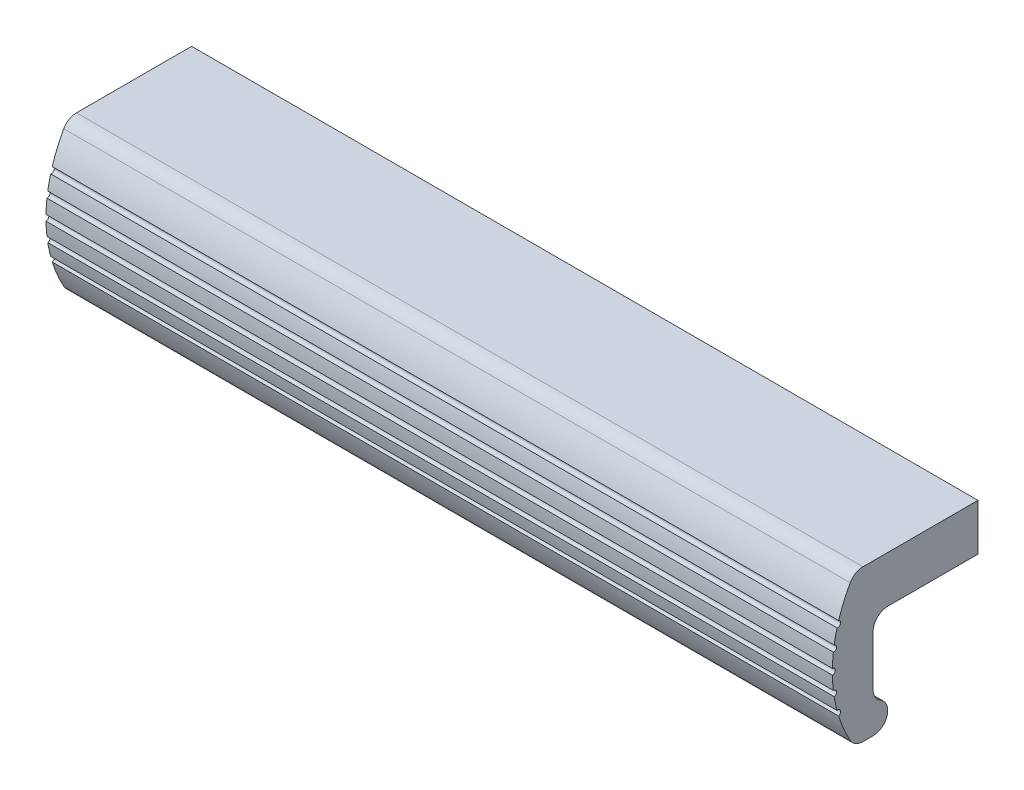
ISO-10303-21;
HEADER;
FILE_DESCRIPTION(('STEP AP214'),'2;1');
FILE_NAME('part.step','',(''),(''),'','','');
FILE_SCHEMA(('AUTOMOTIVE_DESIGN { 1 0 10303 214 1 1 1 1 }'));
ENDSEC;
DATA;
#1=APPLICATION_CONTEXT('core data for automotive mechanical design processes');
#2=APPLICATION_PROTOCOL_DEFINITION('international standard','automotive_design',2000,#1);
#3=PRODUCT_CONTEXT('',#1,'mechanical');
#4=PRODUCT('Part','Part','',(#3));
#5=PRODUCT_RELATED_PRODUCT_CATEGORY('part','',(#4));
#6=PRODUCT_DEFINITION_FORMATION('','',#4);
#7=PRODUCT_DEFINITION_CONTEXT('part definition',#1,'design');
#8=PRODUCT_DEFINITION('design','',#6,#7);
#9=PRODUCT_DEFINITION_SHAPE('','',#8);
#10=(LENGTH_UNIT() NAMED_UNIT(*) SI_UNIT(.MILLI.,.METRE.));
#11=(NAMED_UNIT(*) PLANE_ANGLE_UNIT() SI_UNIT($,.RADIAN.));
#12=(NAMED_UNIT(*) SI_UNIT($,.STERADIAN.) SOLID_ANGLE_UNIT());
#13=UNCERTAINTY_MEASURE_WITH_UNIT(LENGTH_MEASURE(1.E-05),#10,'distance_accuracy_value','');
#14=(GEOMETRIC_REPRESENTATION_CONTEXT(3) GLOBAL_UNCERTAINTY_ASSIGNED_CONTEXT((#13)) GLOBAL_UNIT_ASSIGNED_CONTEXT((#10,
#11,#12)) REPRESENTATION_CONTEXT('',''));
#15=CARTESIAN_POINT('',(0.,0.,0.));
#16=DIRECTION('',(0.,0.,1.));
#17=DIRECTION('',(1.,0.,0.));
#18=AXIS2_PLACEMENT_3D('',#15,#16,#17);
#19=CARTESIAN_POINT('',(-7.5,-4.,0.));
#20=DIRECTION('',(0.,1.,0.));
#21=DIRECTION('',(-1.,0.,0.));
#22=AXIS2_PLACEMENT_3D('',#19,#20,#21);
#23=PLANE('',#22);
#24=DIRECTION('',(1.,0.,0.));
#25=VECTOR('',#24,1.);
#26=CARTESIAN_POINT('',(-7.5,-4.,15.5));
#27=LINE('',#26,#25);
#28=CARTESIAN_POINT('',(-7.5,-4.,15.5));
#29=VERTEX_POINT('',#28);
#30=CARTESIAN_POINT('',(127.5,-4.,15.5));
#31=VERTEX_POINT('',#30);
#32=EDGE_CURVE('E9',#29,#31,#27,.T.);
#33=ORIENTED_EDGE('',*,*,#32,.F.);
#34=DIRECTION('',(0.,0.,1.));
#35=VECTOR('',#34,1.);
#36=CARTESIAN_POINT('',(-7.5,-4.,0.));
#37=LINE('',#36,#35);
#38=CARTESIAN_POINT('',(-7.5,-4.,0.));
#39=VERTEX_POINT('',#38);
#40=EDGE_CURVE('E232',#39,#29,#37,.T.);
#41=ORIENTED_EDGE('',*,*,#40,.F.);
#42=DIRECTION('',(1.,0.,0.));
#43=VECTOR('',#42,1.);
#44=CARTESIAN_POINT('',(-7.5,-4.,0.));
#45=LINE('',#44,#43);
#46=CARTESIAN_POINT('',(127.5,-4.,0.));
#47=VERTEX_POINT('',#46);
#48=EDGE_CURVE('E29',#39,#47,#45,.T.);
#49=ORIENTED_EDGE('',*,*,#48,.T.);
#50=DIRECTION('',(0.,0.,1.));
#51=VECTOR('',#50,1.);
#52=CARTESIAN_POINT('',(127.5,-4.,0.));
#53=LINE('',#52,#51);
#54=EDGE_CURVE('E167',#47,#31,#53,.T.);
#55=ORIENTED_EDGE('',*,*,#54,.T.);
#56=EDGE_LOOP('',(#33,#41,#49,#55));
#57=FACE_BOUND('',#56,.T.);
#58=ADVANCED_FACE('F14',(#57),#23,.F.);
#59=CARTESIAN_POINT('',(-7.5,-6.5,15.5));
#60=DIRECTION('',(1.,0.,0.));
#61=DIRECTION('',(0.,0.,-1.));
#62=AXIS2_PLACEMENT_3D('',#59,#60,#61);
#63=CYLINDRICAL_SURFACE('',#62,2.5);
#64=DIRECTION('',(1.,0.,0.));
#65=VECTOR('',#64,1.);
#66=CARTESIAN_POINT('',(-7.5,-6.5,18.));
#67=LINE('',#66,#65);
#68=CARTESIAN_POINT('',(-7.5,-6.5,18.));
#69=VERTEX_POINT('',#68);
#70=CARTESIAN_POINT('',(127.5,-6.5,18.));
#71=VERTEX_POINT('',#70);
#72=EDGE_CURVE('E22',#69,#71,#67,.T.);
#73=ORIENTED_EDGE('',*,*,#72,.F.);
#74=CARTESIAN_POINT('',(-7.5,-6.5,15.5));
#75=DIRECTION('',(-1.,0.,0.));
#76=DIRECTION('',(0.,0.,1.));
#77=AXIS2_PLACEMENT_3D('',#74,#75,#76);
#78=CIRCLE('',#77,2.5);
#79=EDGE_CURVE('E163',#69,#29,#78,.T.);
#80=ORIENTED_EDGE('',*,*,#79,.T.);
#81=ORIENTED_EDGE('',*,*,#32,.T.);
#82=CARTESIAN_POINT('',(127.5,-6.5,15.5));
#83=DIRECTION('',(-1.,0.,0.));
#84=DIRECTION('',(0.,0.,1.));
#85=AXIS2_PLACEMENT_3D('',#82,#83,#84);
#86=CIRCLE('',#85,2.5);
#87=EDGE_CURVE('E160',#71,#31,#86,.T.);
#88=ORIENTED_EDGE('',*,*,#87,.F.);
#89=EDGE_LOOP('',(#73,#80,#81,#88));
#90=FACE_BOUND('',#89,.T.);
#91=ADVANCED_FACE('F16',(#90),#63,.F.);
#92=CARTESIAN_POINT('',(-7.5,-6.5,18.));
#93=DIRECTION('',(0.,0.,1.));
#94=DIRECTION('',(1.,0.,0.));
#95=AXIS2_PLACEMENT_3D('',#92,#93,#94);
#96=PLANE('',#95);
#97=DIRECTION('',(1.,0.,0.));
#98=VECTOR('',#97,1.);
#99=CARTESIAN_POINT('',(-7.5,-15.1698729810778,18.));
#100=LINE('',#99,#98);
#101=CARTESIAN_POINT('',(-7.5,-15.1698729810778,18.));
#102=VERTEX_POINT('',#101);
#103=CARTESIAN_POINT('',(127.5,-15.1698729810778,18.));
#104=VERTEX_POINT('',#103);
#105=EDGE_CURVE('E324',#102,#104,#100,.T.);
#106=ORIENTED_EDGE('',*,*,#105,.F.);
#107=DIRECTION('',(0.,-1.,0.));
#108=VECTOR('',#107,1.);
#109=CARTESIAN_POINT('',(-7.5,-6.5,18.));
#110=LINE('',#109,#108);
#111=EDGE_CURVE('E235',#69,#102,#110,.T.);
#112=ORIENTED_EDGE('',*,*,#111,.F.);
#113=ORIENTED_EDGE('',*,*,#72,.T.);
#114=DIRECTION('',(0.,-1.,0.));
#115=VECTOR('',#114,1.);
#116=CARTESIAN_POINT('',(127.5,-6.5,18.));
#117=LINE('',#116,#115);
#118=EDGE_CURVE('E175',#71,#104,#117,.T.);
#119=ORIENTED_EDGE('',*,*,#118,.T.);
#120=EDGE_LOOP('',(#106,#112,#113,#119));
#121=FACE_BOUND('',#120,.T.);
#122=ADVANCED_FACE('F327',(#121),#96,.F.);
#123=CARTESIAN_POINT('',(-7.5,-15.1698729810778,15.5));
#124=DIRECTION('',(1.,0.,0.));
#125=DIRECTION('',(0.,0.,-1.));
#126=AXIS2_PLACEMENT_3D('',#123,#124,#125);
#127=CYLINDRICAL_SURFACE('',#126,2.5);
#128=DIRECTION('',(1.,0.,0.));
#129=VECTOR('',#128,1.);
#130=CARTESIAN_POINT('',(-7.5,-17.334936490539,16.75));
#131=LINE('',#130,#129);
#132=CARTESIAN_POINT('',(-7.5,-17.334936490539,16.75));
#133=VERTEX_POINT('',#132);
#134=CARTESIAN_POINT('',(127.5,-17.334936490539,16.75));
#135=VERTEX_POINT('',#134);
#136=EDGE_CURVE('E322',#133,#135,#131,.T.);
#137=ORIENTED_EDGE('',*,*,#136,.F.);
#138=CARTESIAN_POINT('',(-7.5,-15.1698729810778,15.5));
#139=DIRECTION('',(-1.,0.,0.));
#140=DIRECTION('',(0.,0.,1.));
#141=AXIS2_PLACEMENT_3D('',#138,#139,#140);
#142=CIRCLE('',#141,2.5);
#143=EDGE_CURVE('E238',#133,#102,#142,.T.);
#144=ORIENTED_EDGE('',*,*,#143,.T.);
#145=ORIENTED_EDGE('',*,*,#105,.T.);
#146=CARTESIAN_POINT('',(127.5,-15.1698729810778,15.5));
#147=DIRECTION('',(-1.,0.,0.));
#148=DIRECTION('',(0.,0.,1.));
#149=AXIS2_PLACEMENT_3D('',#146,#147,#148);
#150=CIRCLE('',#149,2.5);
#151=EDGE_CURVE('E177',#135,#104,#150,.T.);
#152=ORIENTED_EDGE('',*,*,#151,.F.);
#153=EDGE_LOOP('',(#137,#144,#145,#152));
#154=FACE_BOUND('',#153,.T.);
#155=ADVANCED_FACE('F396',(#154),#127,.F.);
#156=CARTESIAN_POINT('',(-7.5,-19.5,18.));
#157=DIRECTION('',(1.,0.,0.));
#158=DIRECTION('',(0.,0.,-1.));
#159=AXIS2_PLACEMENT_3D('',#156,#157,#158);
#160=CYLINDRICAL_SURFACE('',#159,2.5);
#161=DIRECTION('',(1.,0.,0.));
#162=VECTOR('',#161,1.);
#163=CARTESIAN_POINT('',(-7.5,-22.,18.));
#164=LINE('',#163,#162);
#165=CARTESIAN_POINT('',(-7.5,-22.,18.));
#166=VERTEX_POINT('',#165);
#167=CARTESIAN_POINT('',(127.5,-22.,18.));
#168=VERTEX_POINT('',#167);
#169=EDGE_CURVE('E320',#166,#168,#164,.T.);
#170=ORIENTED_EDGE('',*,*,#169,.F.);
#171=CARTESIAN_POINT('',(-7.5,-19.5,18.));
#172=DIRECTION('',(-1.,0.,0.));
#173=DIRECTION('',(0.,0.,1.));
#174=AXIS2_PLACEMENT_3D('',#171,#172,#173);
#175=CIRCLE('',#174,2.5);
#176=EDGE_CURVE('E241',#133,#166,#175,.T.);
#177=ORIENTED_EDGE('',*,*,#176,.F.);
#178=ORIENTED_EDGE('',*,*,#136,.T.);
#179=CARTESIAN_POINT('',(127.5,-19.5,18.));
#180=DIRECTION('',(-1.,0.,0.));
#181=DIRECTION('',(0.,0.,1.));
#182=AXIS2_PLACEMENT_3D('',#179,#180,#181);
#183=CIRCLE('',#182,2.5);
#184=EDGE_CURVE('E182',#135,#168,#183,.T.);
#185=ORIENTED_EDGE('',*,*,#184,.T.);
#186=EDGE_LOOP('',(#170,#177,#178,#185));
#187=FACE_BOUND('',#186,.T.);
#188=ADVANCED_FACE('F393',(#187),#160,.T.);
#189=CARTESIAN_POINT('',(-7.5,-22.,18.));
#190=DIRECTION('',(0.,1.,0.));
#191=DIRECTION('',(-1.,0.,0.));
#192=AXIS2_PLACEMENT_3D('',#189,#190,#191);
#193=PLANE('',#192);
#194=DIRECTION('',(1.,0.,0.));
#195=VECTOR('',#194,1.);
#196=CARTESIAN_POINT('',(-7.5,-22.,19.7616630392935));
#197=LINE('',#196,#195);
#198=CARTESIAN_POINT('',(-7.5,-22.,19.7616630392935));
#199=VERTEX_POINT('',#198);
#200=CARTESIAN_POINT('',(127.5,-22.,19.7616630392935));
#201=VERTEX_POINT('',#200);
#202=EDGE_CURVE('E318',#199,#201,#197,.T.);
#203=ORIENTED_EDGE('',*,*,#202,.F.);
#204=DIRECTION('',(0.,0.,1.));
#205=VECTOR('',#204,1.);
#206=CARTESIAN_POINT('',(-7.5,-22.,18.));
#207=LINE('',#206,#205);
#208=EDGE_CURVE('E244',#166,#199,#207,.T.);
#209=ORIENTED_EDGE('',*,*,#208,.F.);
#210=ORIENTED_EDGE('',*,*,#169,.T.);
#211=DIRECTION('',(0.,0.,1.));
#212=VECTOR('',#211,1.);
#213=CARTESIAN_POINT('',(127.5,-22.,18.));
#214=LINE('',#213,#212);
#215=EDGE_CURVE('E185',#168,#201,#214,.T.);
#216=ORIENTED_EDGE('',*,*,#215,.T.);
#217=EDGE_LOOP('',(#203,#209,#210,#216));
#218=FACE_BOUND('',#217,.T.);
#219=ADVANCED_FACE('F390',(#218),#193,.F.);
#220=CARTESIAN_POINT('',(-7.5,-19.5,19.7616630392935));
#221=DIRECTION('',(1.,0.,0.));
#222=DIRECTION('',(0.,0.,-1.));
#223=AXIS2_PLACEMENT_3D('',#220,#221,#222);
#224=CYLINDRICAL_SURFACE('',#223,2.5);
#225=DIRECTION('',(1.,0.,0.));
#226=VECTOR('',#225,1.);
#227=CARTESIAN_POINT('',(-7.5,-20.720930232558,21.943251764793));
#228=LINE('',#227,#226);
#229=CARTESIAN_POINT('',(-7.5,-20.720930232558,21.943251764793));
#230=VERTEX_POINT('',#229);
#231=CARTESIAN_POINT('',(127.5,-20.720930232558,21.943251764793));
#232=VERTEX_POINT('',#231);
#233=EDGE_CURVE('E316',#230,#232,#228,.T.);
#234=ORIENTED_EDGE('',*,*,#233,.F.);
#235=CARTESIAN_POINT('',(-7.5,-19.5,19.7616630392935));
#236=DIRECTION('',(-1.,0.,0.));
#237=DIRECTION('',(0.,0.,1.));
#238=AXIS2_PLACEMENT_3D('',#235,#236,#237);
#239=CIRCLE('',#238,2.5);
#240=EDGE_CURVE('E247',#199,#230,#239,.T.);
#241=ORIENTED_EDGE('',*,*,#240,.F.);
#242=ORIENTED_EDGE('',*,*,#202,.T.);
#243=CARTESIAN_POINT('',(127.5,-19.5,19.7616630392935));
#244=DIRECTION('',(-1.,0.,0.));
#245=DIRECTION('',(0.,0.,1.));
#246=AXIS2_PLACEMENT_3D('',#243,#244,#245);
#247=CIRCLE('',#246,2.5);
#248=EDGE_CURVE('E188',#201,#232,#247,.T.);
#249=ORIENTED_EDGE('',*,*,#248,.T.);
#250=EDGE_LOOP('',(#234,#241,#242,#249));
#251=FACE_BOUND('',#250,.T.);
#252=ADVANCED_FACE('F386',(#251),#224,.T.);
#253=CARTESIAN_POINT('',(-7.5,-9.,1.));
#254=DIRECTION('',(1.,0.,0.));
#255=DIRECTION('',(0.,0.,-1.));
#256=AXIS2_PLACEMENT_3D('',#253,#254,#255);
#257=CYLINDRICAL_SURFACE('',#256,24.);
#258=DIRECTION('',(1.,0.,0.));
#259=VECTOR('',#258,1.);
#260=CARTESIAN_POINT('',(-7.5,-16.094465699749,23.9274629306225));
#261=LINE('',#260,#259);
#262=CARTESIAN_POINT('',(-7.5,-16.094465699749,23.9274629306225));
#263=VERTEX_POINT('',#262);
#264=CARTESIAN_POINT('',(127.5,-16.094465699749,23.9274629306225));
#265=VERTEX_POINT('',#264);
#266=EDGE_CURVE('E314',#263,#265,#261,.T.);
#267=ORIENTED_EDGE('',*,*,#266,.F.);
#268=CARTESIAN_POINT('',(-7.5,-9.,1.));
#269=DIRECTION('',(-1.,0.,0.));
#270=DIRECTION('',(0.,0.,1.));
#271=AXIS2_PLACEMENT_3D('',#268,#269,#270);
#272=CIRCLE('',#271,24.);
#273=EDGE_CURVE('E250',#230,#263,#272,.T.);
#274=ORIENTED_EDGE('',*,*,#273,.F.);
#275=ORIENTED_EDGE('',*,*,#233,.T.);
#276=CARTESIAN_POINT('',(127.5,-9.,1.));
#277=DIRECTION('',(-1.,0.,0.));
#278=DIRECTION('',(0.,0.,1.));
#279=AXIS2_PLACEMENT_3D('',#276,#277,#278);
#280=CIRCLE('',#279,24.);
#281=EDGE_CURVE('E191',#232,#265,#280,.T.);
#282=ORIENTED_EDGE('',*,*,#281,.T.);
#283=EDGE_LOOP('',(#267,#274,#275,#282));
#284=FACE_BOUND('',#283,.T.);
#285=ADVANCED_FACE('F381',(#284),#257,.T.);
#286=CARTESIAN_POINT('',(-7.5,-15.615296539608,24.0702807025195));
#287=DIRECTION('',(1.,0.,0.));
#288=DIRECTION('',(0.,0.,-1.));
#289=AXIS2_PLACEMENT_3D('',#286,#287,#288);
#290=CYLINDRICAL_SURFACE('',#289,0.5);
#291=DIRECTION('',(1.,0.,0.));
#292=VECTOR('',#291,1.);
#293=CARTESIAN_POINT('',(-7.5,-15.1332561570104,24.2030853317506));
#294=LINE('',#293,#292);
#295=CARTESIAN_POINT('',(-7.5,-15.1332561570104,24.2030853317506));
#296=VERTEX_POINT('',#295);
#297=CARTESIAN_POINT('',(127.5,-15.1332561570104,24.2030853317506));
#298=VERTEX_POINT('',#297);
#299=EDGE_CURVE('E312',#296,#298,#294,.T.);
#300=ORIENTED_EDGE('',*,*,#299,.F.);
#301=CARTESIAN_POINT('',(-7.5,-15.615296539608,24.0702807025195));
#302=DIRECTION('',(-1.,0.,0.));
#303=DIRECTION('',(0.,0.,1.));
#304=AXIS2_PLACEMENT_3D('',#301,#302,#303);
#305=CIRCLE('',#304,0.5);
#306=EDGE_CURVE('E253',#296,#263,#305,.T.);
#307=ORIENTED_EDGE('',*,*,#306,.T.);
#308=ORIENTED_EDGE('',*,*,#266,.T.);
#309=CARTESIAN_POINT('',(127.5,-15.615296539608,24.0702807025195));
#310=DIRECTION('',(-1.,0.,0.));
#311=DIRECTION('',(0.,0.,1.));
#312=AXIS2_PLACEMENT_3D('',#309,#310,#311);
#313=CIRCLE('',#312,0.5);
#314=EDGE_CURVE('E194',#298,#265,#313,.T.);
#315=ORIENTED_EDGE('',*,*,#314,.F.);
#316=EDGE_LOOP('',(#300,#307,#308,#315));
#317=FACE_BOUND('',#316,.T.);
#318=ADVANCED_FACE('F378',(#317),#290,.F.);
#319=CARTESIAN_POINT('',(-7.5,-9.,1.));
#320=DIRECTION('',(1.,0.,0.));
#321=DIRECTION('',(0.,0.,-1.));
#322=AXIS2_PLACEMENT_3D('',#319,#320,#321);
#323=CYLINDRICAL_SURFACE('',#322,24.);
#324=DIRECTION('',(1.,0.,0.));
#325=VECTOR('',#324,1.);
#326=CARTESIAN_POINT('',(-7.5,-12.8345367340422,24.6916932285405));
#327=LINE('',#326,#325);
#328=CARTESIAN_POINT('',(-7.5,-12.8345367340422,24.6916932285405));
#329=VERTEX_POINT('',#328);
#330=CARTESIAN_POINT('',(127.5,-12.8345367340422,24.6916932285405));
#331=VERTEX_POINT('',#330);
#332=EDGE_CURVE('E310',#329,#331,#327,.T.);
#333=ORIENTED_EDGE('',*,*,#332,.F.);
#334=CARTESIAN_POINT('',(-7.5,-9.,1.));
#335=DIRECTION('',(-1.,0.,0.));
#336=DIRECTION('',(0.,0.,1.));
#337=AXIS2_PLACEMENT_3D('',#334,#335,#336);
#338=CIRCLE('',#337,24.);
#339=EDGE_CURVE('E256',#296,#329,#338,.T.);
#340=ORIENTED_EDGE('',*,*,#339,.F.);
#341=ORIENTED_EDGE('',*,*,#299,.T.);
#342=CARTESIAN_POINT('',(127.5,-9.,1.));
#343=DIRECTION('',(-1.,0.,0.));
#344=DIRECTION('',(0.,0.,1.));
#345=AXIS2_PLACEMENT_3D('',#342,#343,#344);
#346=CIRCLE('',#345,24.);
#347=EDGE_CURVE('E197',#298,#331,#346,.T.);
#348=ORIENTED_EDGE('',*,*,#347,.T.);
#349=EDGE_LOOP('',(#333,#340,#341,#348));
#350=FACE_BOUND('',#349,.T.);
#351=ADVANCED_FACE('F374',(#350),#323,.T.);
#352=CARTESIAN_POINT('',(-7.5,-12.3401544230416,24.7664336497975));
#353=DIRECTION('',(1.,0.,0.));
#354=DIRECTION('',(0.,0.,-1.));
#355=AXIS2_PLACEMENT_3D('',#352,#353,#354);
#356=CYLINDRICAL_SURFACE('',#355,0.5);
#357=DIRECTION('',(1.,0.,0.));
#358=VECTOR('',#357,1.);
#359=CARTESIAN_POINT('',(-7.5,-11.8443223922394,24.830858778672));
#360=LINE('',#359,#358);
#361=CARTESIAN_POINT('',(-7.5,-11.8443223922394,24.830858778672));
#362=VERTEX_POINT('',#361);
#363=CARTESIAN_POINT('',(127.5,-11.8443223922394,24.830858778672));
#364=VERTEX_POINT('',#363);
#365=EDGE_CURVE('E308',#362,#364,#360,.T.);
#366=ORIENTED_EDGE('',*,*,#365,.F.);
#367=CARTESIAN_POINT('',(-7.5,-12.3401544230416,24.7664336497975));
#368=DIRECTION('',(-1.,0.,0.));
#369=DIRECTION('',(0.,0.,1.));
#370=AXIS2_PLACEMENT_3D('',#367,#368,#369);
#371=CIRCLE('',#370,0.5);
#372=EDGE_CURVE('E259',#362,#329,#371,.T.);
#373=ORIENTED_EDGE('',*,*,#372,.T.);
#374=ORIENTED_EDGE('',*,*,#332,.T.);
#375=CARTESIAN_POINT('',(127.5,-12.3401544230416,24.7664336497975));
#376=DIRECTION('',(-1.,0.,0.));
#377=DIRECTION('',(0.,0.,1.));
#378=AXIS2_PLACEMENT_3D('',#375,#376,#377);
#379=CIRCLE('',#378,0.5);
#380=EDGE_CURVE('E200',#364,#331,#379,.T.);
#381=ORIENTED_EDGE('',*,*,#380,.F.);
#382=EDGE_LOOP('',(#366,#373,#374,#381));
#383=FACE_BOUND('',#382,.T.);
#384=ADVANCED_FACE('F369',(#383),#356,.F.);
#385=CARTESIAN_POINT('',(-7.5,-9.,1.));
#386=DIRECTION('',(1.,0.,0.));
#387=DIRECTION('',(0.,0.,-1.));
#388=AXIS2_PLACEMENT_3D('',#385,#386,#387);
#389=CYLINDRICAL_SURFACE('',#388,24.);
#390=DIRECTION('',(1.,0.,0.));
#391=VECTOR('',#390,1.);
#392=CARTESIAN_POINT('',(-7.5,-9.49997287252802,24.9947916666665));
#393=LINE('',#392,#391);
#394=CARTESIAN_POINT('',(-7.5,-9.49997287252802,24.9947916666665));
#395=VERTEX_POINT('',#394);
#396=CARTESIAN_POINT('',(127.5,-9.49997287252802,24.9947916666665));
#397=VERTEX_POINT('',#396);
#398=EDGE_CURVE('E306',#395,#397,#393,.T.);
#399=ORIENTED_EDGE('',*,*,#398,.F.);
#400=CARTESIAN_POINT('',(-7.5,-9.,1.));
#401=DIRECTION('',(-1.,0.,0.));
#402=DIRECTION('',(0.,0.,1.));
#403=AXIS2_PLACEMENT_3D('',#400,#401,#402);
#404=CIRCLE('',#403,24.);
#405=EDGE_CURVE('E262',#362,#395,#404,.T.);
#406=ORIENTED_EDGE('',*,*,#405,.F.);
#407=ORIENTED_EDGE('',*,*,#365,.T.);
#408=CARTESIAN_POINT('',(127.5,-9.,1.));
#409=DIRECTION('',(-1.,0.,0.));
#410=DIRECTION('',(0.,0.,1.));
#411=AXIS2_PLACEMENT_3D('',#408,#409,#410);
#412=CIRCLE('',#411,24.);
#413=EDGE_CURVE('E203',#364,#397,#412,.T.);
#414=ORIENTED_EDGE('',*,*,#413,.T.);
#415=EDGE_LOOP('',(#399,#406,#407,#414));
#416=FACE_BOUND('',#415,.T.);
#417=ADVANCED_FACE('F365',(#416),#389,.T.);
#418=CARTESIAN_POINT('',(-7.5,-9.,25.));
#419=DIRECTION('',(1.,0.,0.));
#420=DIRECTION('',(0.,0.,-1.));
#421=AXIS2_PLACEMENT_3D('',#418,#419,#420);
#422=CYLINDRICAL_SURFACE('',#421,0.500000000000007);
#423=DIRECTION('',(1.,0.,0.));
#424=VECTOR('',#423,1.);
#425=CARTESIAN_POINT('',(-7.5,-8.50002712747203,24.9947916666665));
#426=LINE('',#425,#424);
#427=CARTESIAN_POINT('',(-7.5,-8.50002712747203,24.9947916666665));
#428=VERTEX_POINT('',#427);
#429=CARTESIAN_POINT('',(127.5,-8.50002712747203,24.9947916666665));
#430=VERTEX_POINT('',#429);
#431=EDGE_CURVE('E304',#428,#430,#426,.T.);
#432=ORIENTED_EDGE('',*,*,#431,.F.);
#433=CARTESIAN_POINT('',(-7.5,-9.,25.));
#434=DIRECTION('',(-1.,0.,0.));
#435=DIRECTION('',(0.,0.,1.));
#436=AXIS2_PLACEMENT_3D('',#433,#434,#435);
#437=CIRCLE('',#436,0.500000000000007);
#438=EDGE_CURVE('E265',#428,#395,#437,.T.);
#439=ORIENTED_EDGE('',*,*,#438,.T.);
#440=ORIENTED_EDGE('',*,*,#398,.T.);
#441=CARTESIAN_POINT('',(127.5,-9.,25.));
#442=DIRECTION('',(-1.,0.,0.));
#443=DIRECTION('',(0.,0.,1.));
#444=AXIS2_PLACEMENT_3D('',#441,#442,#443);
#445=CIRCLE('',#444,0.500000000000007);
#446=EDGE_CURVE('E206',#430,#397,#445,.T.);
#447=ORIENTED_EDGE('',*,*,#446,.F.);
#448=EDGE_LOOP('',(#432,#439,#440,#447));
#449=FACE_BOUND('',#448,.T.);
#450=ADVANCED_FACE('F361',(#449),#422,.F.);
#451=CARTESIAN_POINT('',(-7.5,-9.,1.));
#452=DIRECTION('',(1.,0.,0.));
#453=DIRECTION('',(0.,0.,-1.));
#454=AXIS2_PLACEMENT_3D('',#451,#452,#453);
#455=CYLINDRICAL_SURFACE('',#454,24.);
#456=DIRECTION('',(1.,0.,0.));
#457=VECTOR('',#456,1.);
#458=CARTESIAN_POINT('',(-7.5,-6.15567760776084,24.830858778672));
#459=LINE('',#458,#457);
#460=CARTESIAN_POINT('',(-7.5,-6.15567760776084,24.830858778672));
#461=VERTEX_POINT('',#460);
#462=CARTESIAN_POINT('',(127.5,-6.15567760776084,24.830858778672));
#463=VERTEX_POINT('',#462);
#464=EDGE_CURVE('E302',#461,#463,#459,.T.);
#465=ORIENTED_EDGE('',*,*,#464,.F.);
#466=CARTESIAN_POINT('',(-7.5,-9.,1.));
#467=DIRECTION('',(-1.,0.,0.));
#468=DIRECTION('',(0.,0.,1.));
#469=AXIS2_PLACEMENT_3D('',#466,#467,#468);
#470=CIRCLE('',#469,24.);
#471=EDGE_CURVE('E268',#428,#461,#470,.T.);
#472=ORIENTED_EDGE('',*,*,#471,.F.);
#473=ORIENTED_EDGE('',*,*,#431,.T.);
#474=CARTESIAN_POINT('',(127.5,-9.,1.));
#475=DIRECTION('',(-1.,0.,0.));
#476=DIRECTION('',(0.,0.,1.));
#477=AXIS2_PLACEMENT_3D('',#474,#475,#476);
#478=CIRCLE('',#477,24.);
#479=EDGE_CURVE('E209',#430,#463,#478,.T.);
#480=ORIENTED_EDGE('',*,*,#479,.T.);
#481=EDGE_LOOP('',(#465,#472,#473,#480));
#482=FACE_BOUND('',#481,.T.);
#483=ADVANCED_FACE('F357',(#482),#455,.T.);
#484=CARTESIAN_POINT('',(-7.5,-5.65984557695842,24.7664336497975));
#485=DIRECTION('',(1.,0.,0.));
#486=DIRECTION('',(0.,0.,-1.));
#487=AXIS2_PLACEMENT_3D('',#484,#485,#486);
#488=CYLINDRICAL_SURFACE('',#487,0.499999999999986);
#489=DIRECTION('',(1.,0.,0.));
#490=VECTOR('',#489,1.);
#491=CARTESIAN_POINT('',(-7.5,-5.16546326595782,24.6916932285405));
#492=LINE('',#491,#490);
#493=CARTESIAN_POINT('',(-7.5,-5.16546326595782,24.6916932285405));
#494=VERTEX_POINT('',#493);
#495=CARTESIAN_POINT('',(127.5,-5.16546326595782,24.6916932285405));
#496=VERTEX_POINT('',#495);
#497=EDGE_CURVE('E300',#494,#496,#492,.T.);
#498=ORIENTED_EDGE('',*,*,#497,.F.);
#499=CARTESIAN_POINT('',(-7.5,-5.65984557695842,24.7664336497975));
#500=DIRECTION('',(-1.,0.,0.));
#501=DIRECTION('',(0.,0.,1.));
#502=AXIS2_PLACEMENT_3D('',#499,#500,#501);
#503=CIRCLE('',#502,0.499999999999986);
#504=EDGE_CURVE('E271',#494,#461,#503,.T.);
#505=ORIENTED_EDGE('',*,*,#504,.T.);
#506=ORIENTED_EDGE('',*,*,#464,.T.);
#507=CARTESIAN_POINT('',(127.5,-5.65984557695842,24.7664336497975));
#508=DIRECTION('',(-1.,0.,0.));
#509=DIRECTION('',(0.,0.,1.));
#510=AXIS2_PLACEMENT_3D('',#507,#508,#509);
#511=CIRCLE('',#510,0.499999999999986);
#512=EDGE_CURVE('E212',#496,#463,#511,.T.);
#513=ORIENTED_EDGE('',*,*,#512,.F.);
#514=EDGE_LOOP('',(#498,#505,#506,#513));
#515=FACE_BOUND('',#514,.T.);
#516=ADVANCED_FACE('F354',(#515),#488,.F.);
#517=CARTESIAN_POINT('',(-7.5,-9.,1.));
#518=DIRECTION('',(1.,0.,0.));
#519=DIRECTION('',(0.,0.,-1.));
#520=AXIS2_PLACEMENT_3D('',#517,#518,#519);
#521=CYLINDRICAL_SURFACE('',#520,24.);
#522=DIRECTION('',(1.,0.,0.));
#523=VECTOR('',#522,1.);
#524=CARTESIAN_POINT('',(-7.5,-2.8667438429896,24.2030853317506));
#525=LINE('',#524,#523);
#526=CARTESIAN_POINT('',(-7.5,-2.8667438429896,24.2030853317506));
#527=VERTEX_POINT('',#526);
#528=CARTESIAN_POINT('',(127.5,-2.8667438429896,24.2030853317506));
#529=VERTEX_POINT('',#528);
#530=EDGE_CURVE('E298',#527,#529,#525,.T.);
#531=ORIENTED_EDGE('',*,*,#530,.F.);
#532=CARTESIAN_POINT('',(-7.5,-9.,1.));
#533=DIRECTION('',(-1.,0.,0.));
#534=DIRECTION('',(0.,0.,1.));
#535=AXIS2_PLACEMENT_3D('',#532,#533,#534);
#536=CIRCLE('',#535,24.);
#537=EDGE_CURVE('E274',#494,#527,#536,.T.);
#538=ORIENTED_EDGE('',*,*,#537,.F.);
#539=ORIENTED_EDGE('',*,*,#497,.T.);
#540=CARTESIAN_POINT('',(127.5,-9.,1.));
#541=DIRECTION('',(-1.,0.,0.));
#542=DIRECTION('',(0.,0.,1.));
#543=AXIS2_PLACEMENT_3D('',#540,#541,#542);
#544=CIRCLE('',#543,24.);
#545=EDGE_CURVE('E215',#496,#529,#544,.T.);
#546=ORIENTED_EDGE('',*,*,#545,.T.);
#547=EDGE_LOOP('',(#531,#538,#539,#546));
#548=FACE_BOUND('',#547,.T.);
#549=ADVANCED_FACE('F350',(#548),#521,.T.);
#550=CARTESIAN_POINT('',(-7.5,-2.38470346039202,24.0702807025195));
#551=DIRECTION('',(1.,0.,0.));
#552=DIRECTION('',(0.,0.,-1.));
#553=AXIS2_PLACEMENT_3D('',#550,#551,#552);
#554=CYLINDRICAL_SURFACE('',#553,0.500000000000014);
#555=DIRECTION('',(1.,0.,0.));
#556=VECTOR('',#555,1.);
#557=CARTESIAN_POINT('',(-7.5,-1.90553430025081,23.9274629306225));
#558=LINE('',#557,#556);
#559=CARTESIAN_POINT('',(-7.5,-1.90553430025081,23.9274629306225));
#560=VERTEX_POINT('',#559);
#561=CARTESIAN_POINT('',(127.5,-1.90553430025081,23.9274629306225));
#562=VERTEX_POINT('',#561);
#563=EDGE_CURVE('E296',#560,#562,#558,.T.);
#564=ORIENTED_EDGE('',*,*,#563,.F.);
#565=CARTESIAN_POINT('',(-7.5,-2.38470346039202,24.0702807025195));
#566=DIRECTION('',(-1.,0.,0.));
#567=DIRECTION('',(0.,0.,1.));
#568=AXIS2_PLACEMENT_3D('',#565,#566,#567);
#569=CIRCLE('',#568,0.500000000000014);
#570=EDGE_CURVE('E277',#560,#527,#569,.T.);
#571=ORIENTED_EDGE('',*,*,#570,.T.);
#572=ORIENTED_EDGE('',*,*,#530,.T.);
#573=CARTESIAN_POINT('',(127.5,-2.38470346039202,24.0702807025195));
#574=DIRECTION('',(-1.,0.,0.));
#575=DIRECTION('',(0.,0.,1.));
#576=AXIS2_PLACEMENT_3D('',#573,#574,#575);
#577=CIRCLE('',#576,0.500000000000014);
#578=EDGE_CURVE('E218',#562,#529,#577,.T.);
#579=ORIENTED_EDGE('',*,*,#578,.F.);
#580=EDGE_LOOP('',(#564,#571,#572,#579));
#581=FACE_BOUND('',#580,.T.);
#582=ADVANCED_FACE('F345',(#581),#554,.F.);
#583=CARTESIAN_POINT('',(-7.5,-9.,1.));
#584=DIRECTION('',(1.,0.,0.));
#585=DIRECTION('',(0.,0.,-1.));
#586=AXIS2_PLACEMENT_3D('',#583,#584,#585);
#587=CYLINDRICAL_SURFACE('',#586,24.);
#588=DIRECTION('',(1.,0.,0.));
#589=VECTOR('',#588,1.);
#590=CARTESIAN_POINT('',(-7.5,2.72093023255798,21.943251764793));
#591=LINE('',#590,#589);
#592=CARTESIAN_POINT('',(-7.5,2.72093023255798,21.943251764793));
#593=VERTEX_POINT('',#592);
#594=CARTESIAN_POINT('',(127.5,2.72093023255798,21.943251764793));
#595=VERTEX_POINT('',#594);
#596=EDGE_CURVE('E294',#593,#595,#591,.T.);
#597=ORIENTED_EDGE('',*,*,#596,.F.);
#598=CARTESIAN_POINT('',(-7.5,-9.,1.));
#599=DIRECTION('',(-1.,0.,0.));
#600=DIRECTION('',(0.,0.,1.));
#601=AXIS2_PLACEMENT_3D('',#598,#599,#600);
#602=CIRCLE('',#601,24.);
#603=EDGE_CURVE('E280',#560,#593,#602,.T.);
#604=ORIENTED_EDGE('',*,*,#603,.F.);
#605=ORIENTED_EDGE('',*,*,#563,.T.);
#606=CARTESIAN_POINT('',(127.5,-9.,1.));
#607=DIRECTION('',(-1.,0.,0.));
#608=DIRECTION('',(0.,0.,1.));
#609=AXIS2_PLACEMENT_3D('',#606,#607,#608);
#610=CIRCLE('',#609,24.);
#611=EDGE_CURVE('E221',#562,#595,#610,.T.);
#612=ORIENTED_EDGE('',*,*,#611,.T.);
#613=EDGE_LOOP('',(#597,#604,#605,#612));
#614=FACE_BOUND('',#613,.T.);
#615=ADVANCED_FACE('F341',(#614),#587,.T.);
#616=CARTESIAN_POINT('',(-7.5,1.5,19.7616630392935));
#617=DIRECTION('',(1.,0.,0.));
#618=DIRECTION('',(0.,0.,-1.));
#619=AXIS2_PLACEMENT_3D('',#616,#617,#618);
#620=CYLINDRICAL_SURFACE('',#619,2.5);
#621=DIRECTION('',(1.,0.,0.));
#622=VECTOR('',#621,1.);
#623=CARTESIAN_POINT('',(-7.5,4.,19.7616630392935));
#624=LINE('',#623,#622);
#625=CARTESIAN_POINT('',(-7.5,4.,19.7616630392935));
#626=VERTEX_POINT('',#625);
#627=CARTESIAN_POINT('',(127.5,4.,19.7616630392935));
#628=VERTEX_POINT('',#627);
#629=EDGE_CURVE('E292',#626,#628,#624,.T.);
#630=ORIENTED_EDGE('',*,*,#629,.F.);
#631=CARTESIAN_POINT('',(-7.5,1.5,19.7616630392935));
#632=DIRECTION('',(-1.,0.,0.));
#633=DIRECTION('',(0.,0.,1.));
#634=AXIS2_PLACEMENT_3D('',#631,#632,#633);
#635=CIRCLE('',#634,2.5);
#636=EDGE_CURVE('E283',#593,#626,#635,.T.);
#637=ORIENTED_EDGE('',*,*,#636,.F.);
#638=ORIENTED_EDGE('',*,*,#596,.T.);
#639=CARTESIAN_POINT('',(127.5,1.5,19.7616630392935));
#640=DIRECTION('',(-1.,0.,0.));
#641=DIRECTION('',(0.,0.,1.));
#642=AXIS2_PLACEMENT_3D('',#639,#640,#641);
#643=CIRCLE('',#642,2.5);
#644=EDGE_CURVE('E224',#595,#628,#643,.T.);
#645=ORIENTED_EDGE('',*,*,#644,.T.);
#646=EDGE_LOOP('',(#630,#637,#638,#645));
#647=FACE_BOUND('',#646,.T.);
#648=ADVANCED_FACE('F337',(#647),#620,.T.);
#649=CARTESIAN_POINT('',(-7.5,4.,0.));
#650=DIRECTION('',(0.,1.,0.));
#651=DIRECTION('',(-1.,0.,0.));
#652=AXIS2_PLACEMENT_3D('',#649,#650,#651);
#653=PLANE('',#652);
#654=DIRECTION('',(1.,0.,0.));
#655=VECTOR('',#654,1.);
#656=CARTESIAN_POINT('',(-7.5,4.,0.));
#657=LINE('',#656,#655);
#658=CARTESIAN_POINT('',(-7.5,4.,0.));
#659=VERTEX_POINT('',#658);
#660=CARTESIAN_POINT('',(127.5,4.,0.));
#661=VERTEX_POINT('',#660);
#662=EDGE_CURVE('E37',#659,#661,#657,.T.);
#663=ORIENTED_EDGE('',*,*,#662,.F.);
#664=DIRECTION('',(0.,0.,1.));
#665=VECTOR('',#664,1.);
#666=CARTESIAN_POINT('',(-7.5,4.,0.));
#667=LINE('',#666,#665);
#668=EDGE_CURVE('E286',#659,#626,#667,.T.);
#669=ORIENTED_EDGE('',*,*,#668,.T.);
#670=ORIENTED_EDGE('',*,*,#629,.T.);
#671=DIRECTION('',(0.,0.,1.));
#672=VECTOR('',#671,1.);
#673=CARTESIAN_POINT('',(127.5,4.,0.));
#674=LINE('',#673,#672);
#675=EDGE_CURVE('E227',#661,#628,#674,.T.);
#676=ORIENTED_EDGE('',*,*,#675,.F.);
#677=EDGE_LOOP('',(#663,#669,#670,#676));
#678=FACE_BOUND('',#677,.T.);
#679=ADVANCED_FACE('F333',(#678),#653,.T.);
#680=CARTESIAN_POINT('',(-7.5,-4.,0.));
#681=DIRECTION('',(0.,0.,-1.));
#682=DIRECTION('',(-1.,0.,0.));
#683=AXIS2_PLACEMENT_3D('',#680,#681,#682);
#684=PLANE('',#683);
#685=CARTESIAN_POINT('',(0.,0.,0.));
#686=DIRECTION('',(0.,0.,-1.));
#687=DIRECTION('',(-1.,0.,0.));
#688=AXIS2_PLACEMENT_3D('',#685,#686,#687);
#689=CIRCLE('',#688,2.);
#690=CARTESIAN_POINT('',(-2.,0.,0.));
#691=VERTEX_POINT('',#690);
#692=EDGE_CURVE('E632',#691,#691,#689,.T.);
#693=ORIENTED_EDGE('',*,*,#692,.F.);
#694=EDGE_LOOP('',(#693));
#695=FACE_BOUND('',#694,.T.);
#696=CARTESIAN_POINT('',(120.,0.,0.));
#697=DIRECTION('',(0.,0.,-1.));
#698=DIRECTION('',(-1.,0.,0.));
#699=AXIS2_PLACEMENT_3D('',#696,#697,#698);
#700=CIRCLE('',#699,2.);
#701=CARTESIAN_POINT('',(118.,0.,0.));
#702=VERTEX_POINT('',#701);
#703=EDGE_CURVE('E631',#702,#702,#700,.T.);
#704=ORIENTED_EDGE('',*,*,#703,.F.);
#705=EDGE_LOOP('',(#704));
#706=FACE_BOUND('',#705,.T.);
#707=DIRECTION('',(0.,1.,0.));
#708=VECTOR('',#707,1.);
#709=CARTESIAN_POINT('',(-7.5,-4.,0.));
#710=LINE('',#709,#708);
#711=EDGE_CURVE('E288',#39,#659,#710,.T.);
#712=ORIENTED_EDGE('',*,*,#711,.T.);
#713=ORIENTED_EDGE('',*,*,#662,.T.);
#714=DIRECTION('',(0.,1.,0.));
#715=VECTOR('',#714,1.);
#716=CARTESIAN_POINT('',(127.5,-4.,0.));
#717=LINE('',#716,#715);
#718=EDGE_CURVE('E230',#47,#661,#717,.T.);
#719=ORIENTED_EDGE('',*,*,#718,.F.);
#720=ORIENTED_EDGE('',*,*,#48,.F.);
#721=EDGE_LOOP('',(#712,#713,#719,#720));
#722=FACE_BOUND('',#721,.T.);
#723=ADVANCED_FACE('F332',(#695,#706,#722),#684,.T.);
#724=CARTESIAN_POINT('',(-7.5,-6.5,15.5));
#725=DIRECTION('',(-1.,0.,0.));
#726=DIRECTION('',(0.,0.,1.));
#727=AXIS2_PLACEMENT_3D('',#724,#725,#726);
#728=PLANE('',#727);
#729=ORIENTED_EDGE('',*,*,#40,.T.);
#730=ORIENTED_EDGE('',*,*,#79,.F.);
#731=ORIENTED_EDGE('',*,*,#111,.T.);
#732=ORIENTED_EDGE('',*,*,#143,.F.);
#733=ORIENTED_EDGE('',*,*,#176,.T.);
#734=ORIENTED_EDGE('',*,*,#208,.T.);
#735=ORIENTED_EDGE('',*,*,#240,.T.);
#736=ORIENTED_EDGE('',*,*,#273,.T.);
#737=ORIENTED_EDGE('',*,*,#306,.F.);
#738=ORIENTED_EDGE('',*,*,#339,.T.);
#739=ORIENTED_EDGE('',*,*,#372,.F.);
#740=ORIENTED_EDGE('',*,*,#405,.T.);
#741=ORIENTED_EDGE('',*,*,#438,.F.);
#742=ORIENTED_EDGE('',*,*,#471,.T.);
#743=ORIENTED_EDGE('',*,*,#504,.F.);
#744=ORIENTED_EDGE('',*,*,#537,.T.);
#745=ORIENTED_EDGE('',*,*,#570,.F.);
#746=ORIENTED_EDGE('',*,*,#603,.T.);
#747=ORIENTED_EDGE('',*,*,#636,.T.);
#748=ORIENTED_EDGE('',*,*,#668,.F.);
#749=ORIENTED_EDGE('',*,*,#711,.F.);
#750=EDGE_LOOP('',(#729,#730,#731,#732,#733,#734,#735,#736,#737,#738,#739,#740,#741,#742,#743,
#744,#745,#746,#747,#748,#749));
#751=FACE_BOUND('',#750,.T.);
#752=ADVANCED_FACE('F329',(#751),#728,.T.);
#753=CARTESIAN_POINT('',(127.5,-6.5,15.5));
#754=DIRECTION('',(-1.,0.,0.));
#755=DIRECTION('',(0.,0.,1.));
#756=AXIS2_PLACEMENT_3D('',#753,#754,#755);
#757=PLANE('',#756);
#758=ORIENTED_EDGE('',*,*,#54,.F.);
#759=ORIENTED_EDGE('',*,*,#718,.T.);
#760=ORIENTED_EDGE('',*,*,#675,.T.);
#761=ORIENTED_EDGE('',*,*,#644,.F.);
#762=ORIENTED_EDGE('',*,*,#611,.F.);
#763=ORIENTED_EDGE('',*,*,#578,.T.);
#764=ORIENTED_EDGE('',*,*,#545,.F.);
#765=ORIENTED_EDGE('',*,*,#512,.T.);
#766=ORIENTED_EDGE('',*,*,#479,.F.);
#767=ORIENTED_EDGE('',*,*,#446,.T.);
#768=ORIENTED_EDGE('',*,*,#413,.F.);
#769=ORIENTED_EDGE('',*,*,#380,.T.);
#770=ORIENTED_EDGE('',*,*,#347,.F.);
#771=ORIENTED_EDGE('',*,*,#314,.T.);
#772=ORIENTED_EDGE('',*,*,#281,.F.);
#773=ORIENTED_EDGE('',*,*,#248,.F.);
#774=ORIENTED_EDGE('',*,*,#215,.F.);
#775=ORIENTED_EDGE('',*,*,#184,.F.);
#776=ORIENTED_EDGE('',*,*,#151,.T.);
#777=ORIENTED_EDGE('',*,*,#118,.F.);
#778=ORIENTED_EDGE('',*,*,#87,.T.);
#779=EDGE_LOOP('',(#758,#759,#760,#761,#762,#763,#764,#765,#766,#767,#768,#769,#770,#771,#772,
#773,#774,#775,#776,#777,#778));
#780=FACE_BOUND('',#779,.T.);
#781=ADVANCED_FACE('F172',(#780),#757,.F.);
#782=CARTESIAN_POINT('',(120.,0.,8.));
#783=DIRECTION('',(0.,0.,-1.));
#784=DIRECTION('',(-1.,0.,0.));
#785=AXIS2_PLACEMENT_3D('',#782,#783,#784);
#786=CYLINDRICAL_SURFACE('',#785,2.);
#787=CARTESIAN_POINT('',(120.,0.,8.));
#788=DIRECTION('',(0.,0.,-1.));
#789=DIRECTION('',(-1.,0.,0.));
#790=AXIS2_PLACEMENT_3D('',#787,#788,#789);
#791=CIRCLE('',#790,2.);
#792=CARTESIAN_POINT('',(118.,0.,8.));
#793=VERTEX_POINT('',#792);
#794=EDGE_CURVE('E170',#793,#793,#791,.T.);
#795=ORIENTED_EDGE('',*,*,#794,.F.);
#796=EDGE_LOOP('',(#795));
#797=FACE_BOUND('',#796,.T.);
#798=ORIENTED_EDGE('',*,*,#703,.T.);
#799=EDGE_LOOP('',(#798));
#800=FACE_BOUND('',#799,.T.);
#801=ADVANCED_FACE('F545',(#797,#800),#786,.F.);
#802=CARTESIAN_POINT('',(120.,0.,8.));
#803=DIRECTION('',(0.,0.,-1.));
#804=DIRECTION('',(-1.,0.,0.));
#805=AXIS2_PLACEMENT_3D('',#802,#803,#804);
#806=PLANE('',#805);
#807=ORIENTED_EDGE('',*,*,#794,.T.);
#808=EDGE_LOOP('',(#807));
#809=FACE_BOUND('',#808,.T.);
#810=ADVANCED_FACE('F546',(#809),#806,.T.);
#811=CARTESIAN_POINT('',(0.,0.,8.));
#812=DIRECTION('',(0.,0.,-1.));
#813=DIRECTION('',(-1.,0.,0.));
#814=AXIS2_PLACEMENT_3D('',#811,#812,#813);
#815=CYLINDRICAL_SURFACE('',#814,2.);
#816=CARTESIAN_POINT('',(0.,0.,8.));
#817=DIRECTION('',(0.,0.,-1.));
#818=DIRECTION('',(-1.,0.,0.));
#819=AXIS2_PLACEMENT_3D('',#816,#817,#818);
#820=CIRCLE('',#819,2.);
#821=CARTESIAN_POINT('',(-2.,0.,8.));
#822=VERTEX_POINT('',#821);
#823=EDGE_CURVE('E630',#822,#822,#820,.T.);
#824=ORIENTED_EDGE('',*,*,#823,.F.);
#825=EDGE_LOOP('',(#824));
#826=FACE_BOUND('',#825,.T.);
#827=ORIENTED_EDGE('',*,*,#692,.T.);
#828=EDGE_LOOP('',(#827));
#829=FACE_BOUND('',#828,.T.);
#830=ADVANCED_FACE('F562',(#826,#829),#815,.F.);
#831=CARTESIAN_POINT('',(0.,0.,8.));
#832=DIRECTION('',(0.,0.,-1.));
#833=DIRECTION('',(-1.,0.,0.));
#834=AXIS2_PLACEMENT_3D('',#831,#832,#833);
#835=PLANE('',#834);
#836=ORIENTED_EDGE('',*,*,#823,.T.);
#837=EDGE_LOOP('',(#836));
#838=FACE_BOUND('',#837,.T.);
#839=ADVANCED_FACE('F555',(#838),#835,.T.);
#840=CLOSED_SHELL('',(#58,#91,#122,#155,#188,#219,#252,#285,#318,#351,#384,#417,#450,#483,#516,
#549,#582,#615,#648,#679,#723,#752,#781,#801,#810,#830,#839));
#841=MANIFOLD_SOLID_BREP('B1',#840);
#842=ADVANCED_BREP_SHAPE_REPRESENTATION('',(#18,#841),#14);
#843=SHAPE_DEFINITION_REPRESENTATION(#9,#842);
ENDSEC;
END-ISO-10303-21;
